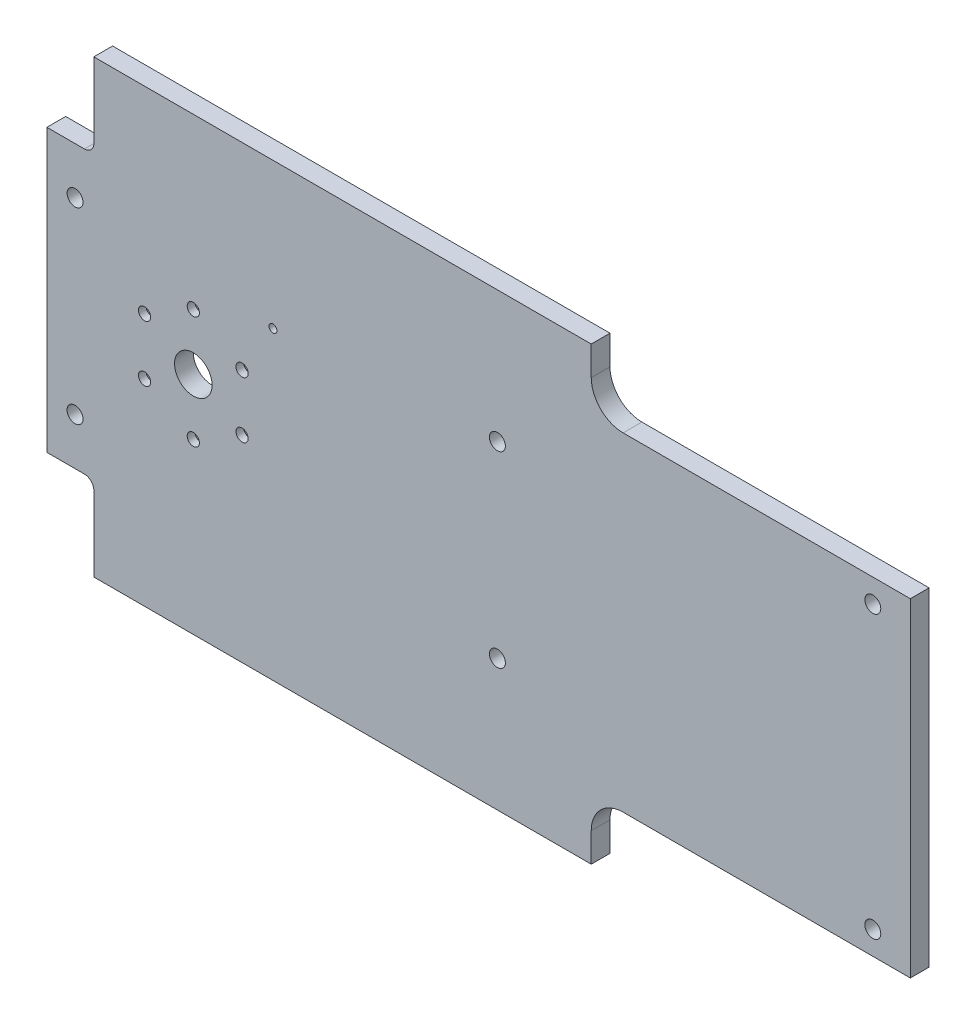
ISO-10303-21;
HEADER;
FILE_DESCRIPTION(('STEP AP214'),'2;1');
FILE_NAME('part.step','',(''),(''),'','','');
FILE_SCHEMA(('AUTOMOTIVE_DESIGN { 1 0 10303 214 1 1 1 1 }'));
ENDSEC;
DATA;
#1=APPLICATION_CONTEXT('core data for automotive mechanical design processes');
#2=APPLICATION_PROTOCOL_DEFINITION('international standard','automotive_design',2000,#1);
#3=PRODUCT_CONTEXT('',#1,'mechanical');
#4=PRODUCT('Part','Part','',(#3));
#5=PRODUCT_RELATED_PRODUCT_CATEGORY('part','',(#4));
#6=PRODUCT_DEFINITION_FORMATION('','',#4);
#7=PRODUCT_DEFINITION_CONTEXT('part definition',#1,'design');
#8=PRODUCT_DEFINITION('design','',#6,#7);
#9=PRODUCT_DEFINITION_SHAPE('','',#8);
#10=(LENGTH_UNIT() NAMED_UNIT(*) SI_UNIT(.MILLI.,.METRE.));
#11=(NAMED_UNIT(*) PLANE_ANGLE_UNIT() SI_UNIT($,.RADIAN.));
#12=(NAMED_UNIT(*) SI_UNIT($,.STERADIAN.) SOLID_ANGLE_UNIT());
#13=UNCERTAINTY_MEASURE_WITH_UNIT(LENGTH_MEASURE(1.E-05),#10,'distance_accuracy_value','');
#14=(GEOMETRIC_REPRESENTATION_CONTEXT(3) GLOBAL_UNCERTAINTY_ASSIGNED_CONTEXT((#13)) GLOBAL_UNIT_ASSIGNED_CONTEXT((#10,
#11,#12)) REPRESENTATION_CONTEXT('',''));
#15=CARTESIAN_POINT('',(0.,0.,0.));
#16=DIRECTION('',(0.,0.,1.));
#17=DIRECTION('',(1.,0.,0.));
#18=AXIS2_PLACEMENT_3D('',#15,#16,#17);
#19=CARTESIAN_POINT('',(-25.9807621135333,-14.9999999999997,0.));
#20=DIRECTION('',(0.,0.,1.));
#21=DIRECTION('',(1.,0.,0.));
#22=AXIS2_PLACEMENT_3D('',#19,#20,#21);
#23=CYLINDRICAL_SURFACE('',#22,3.25);
#24=CARTESIAN_POINT('',(-25.9807621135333,-14.9999999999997,10.));
#25=DIRECTION('',(0.,0.,1.));
#26=DIRECTION('',(0.50000000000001,0.866025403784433,0.));
#27=AXIS2_PLACEMENT_3D('',#24,#25,#26);
#28=CIRCLE('',#27,3.25);
#29=CARTESIAN_POINT('',(-24.3557621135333,-12.1854174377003,10.));
#30=VERTEX_POINT('',#29);
#31=EDGE_CURVE('E271',#30,#30,#28,.T.);
#32=ORIENTED_EDGE('',*,*,#31,.T.);
#33=EDGE_LOOP('',(#32));
#34=FACE_BOUND('',#33,.T.);
#35=CARTESIAN_POINT('',(-25.9807621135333,-14.9999999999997,6.));
#36=DIRECTION('',(0.,0.,-1.));
#37=DIRECTION('',(-1.,0.,0.));
#38=AXIS2_PLACEMENT_3D('',#35,#36,#37);
#39=CIRCLE('',#38,3.25);
#40=CARTESIAN_POINT('',(-29.2307621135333,-14.9999999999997,6.));
#41=VERTEX_POINT('',#40);
#42=EDGE_CURVE('E32',#41,#41,#39,.F.);
#43=ORIENTED_EDGE('',*,*,#42,.F.);
#44=EDGE_LOOP('',(#43));
#45=FACE_BOUND('',#44,.T.);
#46=ADVANCED_FACE('F28',(#34,#45),#23,.F.);
#47=CARTESIAN_POINT('',(-3.07046055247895E-13,-30.,0.));
#48=DIRECTION('',(0.,0.,1.));
#49=DIRECTION('',(1.,0.,0.));
#50=AXIS2_PLACEMENT_3D('',#47,#48,#49);
#51=CYLINDRICAL_SURFACE('',#50,3.25);
#52=CARTESIAN_POINT('',(-3.07046055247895E-13,-30.,10.));
#53=DIRECTION('',(0.,0.,1.));
#54=DIRECTION('',(-0.499999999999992,0.866025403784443,0.));
#55=AXIS2_PLACEMENT_3D('',#52,#53,#54);
#56=CIRCLE('',#55,3.25);
#57=CARTESIAN_POINT('',(-1.62500000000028,-27.1854174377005,10.));
#58=VERTEX_POINT('',#57);
#59=EDGE_CURVE('E311',#58,#58,#56,.T.);
#60=ORIENTED_EDGE('',*,*,#59,.T.);
#61=EDGE_LOOP('',(#60));
#62=FACE_BOUND('',#61,.T.);
#63=CARTESIAN_POINT('',(-3.07046055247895E-13,-30.,6.));
#64=DIRECTION('',(0.,0.,-1.));
#65=DIRECTION('',(-1.,0.,0.));
#66=AXIS2_PLACEMENT_3D('',#63,#64,#65);
#67=CIRCLE('',#66,3.25);
#68=CARTESIAN_POINT('',(-3.25000000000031,-30.,6.));
#69=VERTEX_POINT('',#68);
#70=EDGE_CURVE('E282',#69,#69,#67,.F.);
#71=ORIENTED_EDGE('',*,*,#70,.F.);
#72=EDGE_LOOP('',(#71));
#73=FACE_BOUND('',#72,.T.);
#74=ADVANCED_FACE('F353',(#62,#73),#51,.F.);
#75=CARTESIAN_POINT('',(25.980762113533,-15.0000000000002,0.));
#76=DIRECTION('',(0.,0.,1.));
#77=DIRECTION('',(1.,0.,0.));
#78=AXIS2_PLACEMENT_3D('',#75,#76,#77);
#79=CYLINDRICAL_SURFACE('',#78,3.25);
#80=CARTESIAN_POINT('',(25.980762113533,-15.0000000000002,10.));
#81=DIRECTION('',(0.,0.,1.));
#82=DIRECTION('',(-1.,0.,0.));
#83=AXIS2_PLACEMENT_3D('',#80,#81,#82);
#84=CIRCLE('',#83,3.25);
#85=CARTESIAN_POINT('',(22.730762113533,-15.0000000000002,10.));
#86=VERTEX_POINT('',#85);
#87=EDGE_CURVE('E314',#86,#86,#84,.T.);
#88=ORIENTED_EDGE('',*,*,#87,.T.);
#89=EDGE_LOOP('',(#88));
#90=FACE_BOUND('',#89,.T.);
#91=CARTESIAN_POINT('',(25.980762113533,-15.0000000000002,6.));
#92=DIRECTION('',(0.,0.,-1.));
#93=DIRECTION('',(-1.,0.,0.));
#94=AXIS2_PLACEMENT_3D('',#91,#92,#93);
#95=CIRCLE('',#94,3.25);
#96=CARTESIAN_POINT('',(22.730762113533,-15.0000000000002,6.));
#97=VERTEX_POINT('',#96);
#98=EDGE_CURVE('E278',#97,#97,#95,.F.);
#99=ORIENTED_EDGE('',*,*,#98,.F.);
#100=EDGE_LOOP('',(#99));
#101=FACE_BOUND('',#100,.T.);
#102=ADVANCED_FACE('F359',(#90,#101),#79,.F.);
#103=CARTESIAN_POINT('',(25.9807621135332,14.9999999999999,0.));
#104=DIRECTION('',(0.,0.,1.));
#105=DIRECTION('',(1.,0.,0.));
#106=AXIS2_PLACEMENT_3D('',#103,#104,#105);
#107=CYLINDRICAL_SURFACE('',#106,3.25);
#108=CARTESIAN_POINT('',(25.9807621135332,14.9999999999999,10.));
#109=DIRECTION('',(0.,0.,1.));
#110=DIRECTION('',(-0.500000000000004,-0.866025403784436,0.));
#111=AXIS2_PLACEMENT_3D('',#108,#109,#110);
#112=CIRCLE('',#111,3.25);
#113=CARTESIAN_POINT('',(24.3557621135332,12.1854174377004,10.));
#114=VERTEX_POINT('',#113);
#115=EDGE_CURVE('E317',#114,#114,#112,.T.);
#116=ORIENTED_EDGE('',*,*,#115,.T.);
#117=EDGE_LOOP('',(#116));
#118=FACE_BOUND('',#117,.T.);
#119=CARTESIAN_POINT('',(25.9807621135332,14.9999999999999,6.));
#120=DIRECTION('',(0.,0.,-1.));
#121=DIRECTION('',(-1.,0.,0.));
#122=AXIS2_PLACEMENT_3D('',#119,#120,#121);
#123=CIRCLE('',#122,3.25);
#124=CARTESIAN_POINT('',(22.7307621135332,14.9999999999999,6.));
#125=VERTEX_POINT('',#124);
#126=EDGE_CURVE('E273',#125,#125,#123,.F.);
#127=ORIENTED_EDGE('',*,*,#126,.F.);
#128=EDGE_LOOP('',(#127));
#129=FACE_BOUND('',#128,.T.);
#130=ADVANCED_FACE('F369',(#118,#129),#107,.F.);
#131=CARTESIAN_POINT('',(0.,30.,0.));
#132=DIRECTION('',(0.,0.,1.));
#133=DIRECTION('',(1.,0.,0.));
#134=AXIS2_PLACEMENT_3D('',#131,#132,#133);
#135=CYLINDRICAL_SURFACE('',#134,3.25);
#136=CARTESIAN_POINT('',(0.,30.,10.));
#137=DIRECTION('',(0.,0.,1.));
#138=DIRECTION('',(0.499999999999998,-0.86602540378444,0.));
#139=AXIS2_PLACEMENT_3D('',#136,#137,#138);
#140=CIRCLE('',#139,3.25);
#141=CARTESIAN_POINT('',(1.62500000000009,27.1854174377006,10.));
#142=VERTEX_POINT('',#141);
#143=EDGE_CURVE('E320',#142,#142,#140,.T.);
#144=ORIENTED_EDGE('',*,*,#143,.T.);
#145=EDGE_LOOP('',(#144));
#146=FACE_BOUND('',#145,.T.);
#147=CARTESIAN_POINT('',(0.,30.,6.));
#148=DIRECTION('',(0.,0.,-1.));
#149=DIRECTION('',(-1.,0.,0.));
#150=AXIS2_PLACEMENT_3D('',#147,#148,#149);
#151=CIRCLE('',#150,3.25);
#152=CARTESIAN_POINT('',(-3.24999999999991,30.,6.));
#153=VERTEX_POINT('',#152);
#154=EDGE_CURVE('E268',#153,#153,#151,.F.);
#155=ORIENTED_EDGE('',*,*,#154,.F.);
#156=EDGE_LOOP('',(#155));
#157=FACE_BOUND('',#156,.T.);
#158=ADVANCED_FACE('F373',(#146,#157),#135,.F.);
#159=CARTESIAN_POINT('',(-25.9807621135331,15.,0.));
#160=DIRECTION('',(0.,0.,1.));
#161=DIRECTION('',(1.,0.,0.));
#162=AXIS2_PLACEMENT_3D('',#159,#160,#161);
#163=CYLINDRICAL_SURFACE('',#162,3.25);
#164=CARTESIAN_POINT('',(-25.9807621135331,15.,10.));
#165=DIRECTION('',(0.,0.,1.));
#166=DIRECTION('',(1.,0.,0.));
#167=AXIS2_PLACEMENT_3D('',#164,#165,#166);
#168=CIRCLE('',#167,3.25);
#169=CARTESIAN_POINT('',(-22.7307621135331,15.,10.));
#170=VERTEX_POINT('',#169);
#171=EDGE_CURVE('E161',#170,#170,#168,.T.);
#172=ORIENTED_EDGE('',*,*,#171,.T.);
#173=EDGE_LOOP('',(#172));
#174=FACE_BOUND('',#173,.T.);
#175=CARTESIAN_POINT('',(-25.9807621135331,15.,6.));
#176=DIRECTION('',(0.,0.,-1.));
#177=DIRECTION('',(-1.,0.,0.));
#178=AXIS2_PLACEMENT_3D('',#175,#176,#177);
#179=CIRCLE('',#178,3.25);
#180=CARTESIAN_POINT('',(-29.2307621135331,15.,6.));
#181=VERTEX_POINT('',#180);
#182=EDGE_CURVE('E164',#181,#181,#179,.F.);
#183=ORIENTED_EDGE('',*,*,#182,.F.);
#184=EDGE_LOOP('',(#183));
#185=FACE_BOUND('',#184,.T.);
#186=ADVANCED_FACE('F346',(#174,#185),#163,.F.);
#187=CARTESIAN_POINT('',(-58.,-80.,10.));
#188=DIRECTION('',(0.,0.,1.));
#189=DIRECTION('',(1.,0.,0.));
#190=AXIS2_PLACEMENT_3D('',#187,#188,#189);
#191=PLANE('',#190);
#192=CARTESIAN_POINT('',(0.,0.,10.));
#193=DIRECTION('',(0.,0.,1.));
#194=DIRECTION('',(1.,0.,0.));
#195=AXIS2_PLACEMENT_3D('',#192,#193,#194);
#196=CIRCLE('',#195,10.);
#197=CARTESIAN_POINT('',(10.,0.,10.));
#198=VERTEX_POINT('',#197);
#199=EDGE_CURVE('E721',#198,#198,#196,.T.);
#200=ORIENTED_EDGE('',*,*,#199,.F.);
#201=EDGE_LOOP('',(#200));
#202=FACE_BOUND('',#201,.T.);
#203=CARTESIAN_POINT('',(42.43,42.43,10.));
#204=DIRECTION('',(0.,0.,1.));
#205=DIRECTION('',(1.,0.,0.));
#206=AXIS2_PLACEMENT_3D('',#203,#204,#205);
#207=CIRCLE('',#206,2.1);
#208=CARTESIAN_POINT('',(44.53,42.43,10.));
#209=VERTEX_POINT('',#208);
#210=EDGE_CURVE('E723',#209,#209,#207,.T.);
#211=ORIENTED_EDGE('',*,*,#210,.F.);
#212=EDGE_LOOP('',(#211));
#213=FACE_BOUND('',#212,.T.);
#214=CARTESIAN_POINT('',(-63.,-50.,10.));
#215=DIRECTION('',(0.,0.,1.));
#216=DIRECTION('',(1.,0.,0.));
#217=AXIS2_PLACEMENT_3D('',#214,#215,#216);
#218=CIRCLE('',#217,4.25000000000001);
#219=CARTESIAN_POINT('',(-58.75,-50.,10.));
#220=VERTEX_POINT('',#219);
#221=EDGE_CURVE('E731',#220,#220,#218,.T.);
#222=ORIENTED_EDGE('',*,*,#221,.F.);
#223=EDGE_LOOP('',(#222));
#224=FACE_BOUND('',#223,.T.);
#225=CARTESIAN_POINT('',(-63.,50.,10.));
#226=DIRECTION('',(0.,0.,1.));
#227=DIRECTION('',(1.,0.,0.));
#228=AXIS2_PLACEMENT_3D('',#225,#226,#227);
#229=CIRCLE('',#228,4.25000000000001);
#230=CARTESIAN_POINT('',(-58.75,50.,10.));
#231=VERTEX_POINT('',#230);
#232=EDGE_CURVE('E737',#231,#231,#229,.T.);
#233=ORIENTED_EDGE('',*,*,#232,.F.);
#234=EDGE_LOOP('',(#233));
#235=FACE_BOUND('',#234,.T.);
#236=CARTESIAN_POINT('',(162.,50.,10.));
#237=DIRECTION('',(0.,0.,1.));
#238=DIRECTION('',(1.,0.,0.));
#239=AXIS2_PLACEMENT_3D('',#236,#237,#238);
#240=CIRCLE('',#239,4.25000000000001);
#241=CARTESIAN_POINT('',(166.25,50.,10.));
#242=VERTEX_POINT('',#241);
#243=EDGE_CURVE('E743',#242,#242,#240,.T.);
#244=ORIENTED_EDGE('',*,*,#243,.F.);
#245=EDGE_LOOP('',(#244));
#246=FACE_BOUND('',#245,.T.);
#247=CARTESIAN_POINT('',(162.,-50.,10.));
#248=DIRECTION('',(0.,0.,1.));
#249=DIRECTION('',(1.,0.,0.));
#250=AXIS2_PLACEMENT_3D('',#247,#248,#249);
#251=CIRCLE('',#250,4.25000000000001);
#252=CARTESIAN_POINT('',(166.25,-50.,10.));
#253=VERTEX_POINT('',#252);
#254=EDGE_CURVE('E749',#253,#253,#251,.T.);
#255=ORIENTED_EDGE('',*,*,#254,.F.);
#256=EDGE_LOOP('',(#255));
#257=FACE_BOUND('',#256,.T.);
#258=CARTESIAN_POINT('',(362.,-75.,10.));
#259=DIRECTION('',(0.,0.,1.));
#260=DIRECTION('',(1.,0.,0.));
#261=AXIS2_PLACEMENT_3D('',#258,#259,#260);
#262=CIRCLE('',#261,4.24999999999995);
#263=CARTESIAN_POINT('',(366.25,-75.,10.));
#264=VERTEX_POINT('',#263);
#265=EDGE_CURVE('E755',#264,#264,#262,.T.);
#266=ORIENTED_EDGE('',*,*,#265,.F.);
#267=EDGE_LOOP('',(#266));
#268=FACE_BOUND('',#267,.T.);
#269=CARTESIAN_POINT('',(362.,75.,10.));
#270=DIRECTION('',(0.,0.,1.));
#271=DIRECTION('',(1.,0.,0.));
#272=AXIS2_PLACEMENT_3D('',#269,#270,#271);
#273=CIRCLE('',#272,4.24999999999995);
#274=CARTESIAN_POINT('',(366.25,75.,10.));
#275=VERTEX_POINT('',#274);
#276=EDGE_CURVE('E761',#275,#275,#273,.T.);
#277=ORIENTED_EDGE('',*,*,#276,.F.);
#278=EDGE_LOOP('',(#277));
#279=FACE_BOUND('',#278,.T.);
#280=ORIENTED_EDGE('',*,*,#31,.F.);
#281=EDGE_LOOP('',(#280));
#282=FACE_BOUND('',#281,.T.);
#283=ORIENTED_EDGE('',*,*,#59,.F.);
#284=EDGE_LOOP('',(#283));
#285=FACE_BOUND('',#284,.T.);
#286=ORIENTED_EDGE('',*,*,#87,.F.);
#287=EDGE_LOOP('',(#286));
#288=FACE_BOUND('',#287,.T.);
#289=ORIENTED_EDGE('',*,*,#115,.F.);
#290=EDGE_LOOP('',(#289));
#291=FACE_BOUND('',#290,.T.);
#292=ORIENTED_EDGE('',*,*,#143,.F.);
#293=EDGE_LOOP('',(#292));
#294=FACE_BOUND('',#293,.T.);
#295=ORIENTED_EDGE('',*,*,#171,.F.);
#296=EDGE_LOOP('',(#295));
#297=FACE_BOUND('',#296,.T.);
#298=DIRECTION('',(0.,-1.,0.));
#299=VECTOR('',#298,1.);
#300=CARTESIAN_POINT('',(-53.,-120.,10.));
#301=LINE('',#300,#299);
#302=CARTESIAN_POINT('',(-53.,-80.,10.));
#303=VERTEX_POINT('',#302);
#304=CARTESIAN_POINT('',(-53.,-120.,10.));
#305=VERTEX_POINT('',#304);
#306=EDGE_CURVE('E195',#303,#305,#301,.T.);
#307=ORIENTED_EDGE('',*,*,#306,.T.);
#308=DIRECTION('',(1.,0.,0.));
#309=VECTOR('',#308,1.);
#310=CARTESIAN_POINT('',(-53.,-120.,10.));
#311=LINE('',#310,#309);
#312=CARTESIAN_POINT('',(212.,-120.,10.));
#313=VERTEX_POINT('',#312);
#314=EDGE_CURVE('E156',#305,#313,#311,.T.);
#315=ORIENTED_EDGE('',*,*,#314,.T.);
#316=DIRECTION('',(0.,1.,0.));
#317=VECTOR('',#316,1.);
#318=CARTESIAN_POINT('',(212.,-104.5,10.));
#319=LINE('',#318,#317);
#320=CARTESIAN_POINT('',(212.,-104.5,10.));
#321=VERTEX_POINT('',#320);
#322=EDGE_CURVE('E198',#313,#321,#319,.T.);
#323=ORIENTED_EDGE('',*,*,#322,.T.);
#324=CARTESIAN_POINT('',(229.,-104.5,10.));
#325=DIRECTION('',(0.,0.,-1.));
#326=DIRECTION('',(-1.,0.,0.));
#327=AXIS2_PLACEMENT_3D('',#324,#325,#326);
#328=CIRCLE('',#327,17.);
#329=CARTESIAN_POINT('',(229.,-87.5,10.));
#330=VERTEX_POINT('',#329);
#331=EDGE_CURVE('E200',#321,#330,#328,.T.);
#332=ORIENTED_EDGE('',*,*,#331,.T.);
#333=DIRECTION('',(1.,0.,0.));
#334=VECTOR('',#333,1.);
#335=CARTESIAN_POINT('',(382.,-87.5,10.));
#336=LINE('',#335,#334);
#337=CARTESIAN_POINT('',(382.,-87.5,10.));
#338=VERTEX_POINT('',#337);
#339=EDGE_CURVE('E202',#330,#338,#336,.T.);
#340=ORIENTED_EDGE('',*,*,#339,.T.);
#341=DIRECTION('',(0.,1.,0.));
#342=VECTOR('',#341,1.);
#343=CARTESIAN_POINT('',(382.,87.5,10.));
#344=LINE('',#343,#342);
#345=CARTESIAN_POINT('',(382.,87.5,10.));
#346=VERTEX_POINT('',#345);
#347=EDGE_CURVE('E204',#338,#346,#344,.T.);
#348=ORIENTED_EDGE('',*,*,#347,.T.);
#349=DIRECTION('',(-1.,0.,0.));
#350=VECTOR('',#349,1.);
#351=CARTESIAN_POINT('',(382.,87.5,10.));
#352=LINE('',#351,#350);
#353=CARTESIAN_POINT('',(229.,87.5,10.));
#354=VERTEX_POINT('',#353);
#355=EDGE_CURVE('E206',#346,#354,#352,.T.);
#356=ORIENTED_EDGE('',*,*,#355,.T.);
#357=CARTESIAN_POINT('',(229.,104.5,10.));
#358=DIRECTION('',(0.,0.,-1.));
#359=DIRECTION('',(1.,0.,0.));
#360=AXIS2_PLACEMENT_3D('',#357,#358,#359);
#361=CIRCLE('',#360,17.);
#362=CARTESIAN_POINT('',(212.,104.5,10.));
#363=VERTEX_POINT('',#362);
#364=EDGE_CURVE('E208',#354,#363,#361,.T.);
#365=ORIENTED_EDGE('',*,*,#364,.T.);
#366=DIRECTION('',(0.,1.,0.));
#367=VECTOR('',#366,1.);
#368=CARTESIAN_POINT('',(212.,104.5,10.));
#369=LINE('',#368,#367);
#370=CARTESIAN_POINT('',(212.,120.,10.));
#371=VERTEX_POINT('',#370);
#372=EDGE_CURVE('E210',#363,#371,#369,.T.);
#373=ORIENTED_EDGE('',*,*,#372,.T.);
#374=DIRECTION('',(-1.,0.,0.));
#375=VECTOR('',#374,1.);
#376=CARTESIAN_POINT('',(-53.,120.,10.));
#377=LINE('',#376,#375);
#378=CARTESIAN_POINT('',(-53.,120.,10.));
#379=VERTEX_POINT('',#378);
#380=EDGE_CURVE('E212',#371,#379,#377,.T.);
#381=ORIENTED_EDGE('',*,*,#380,.T.);
#382=DIRECTION('',(0.,-1.,0.));
#383=VECTOR('',#382,1.);
#384=CARTESIAN_POINT('',(-53.,120.,10.));
#385=LINE('',#384,#383);
#386=CARTESIAN_POINT('',(-53.,80.,10.));
#387=VERTEX_POINT('',#386);
#388=EDGE_CURVE('E214',#379,#387,#385,.T.);
#389=ORIENTED_EDGE('',*,*,#388,.T.);
#390=CARTESIAN_POINT('',(-58.,80.,10.));
#391=DIRECTION('',(0.,0.,-1.));
#392=DIRECTION('',(-1.,0.,0.));
#393=AXIS2_PLACEMENT_3D('',#390,#391,#392);
#394=CIRCLE('',#393,5.);
#395=CARTESIAN_POINT('',(-58.,75.,10.));
#396=VERTEX_POINT('',#395);
#397=EDGE_CURVE('E216',#387,#396,#394,.T.);
#398=ORIENTED_EDGE('',*,*,#397,.T.);
#399=DIRECTION('',(-1.,0.,0.));
#400=VECTOR('',#399,1.);
#401=CARTESIAN_POINT('',(-78.,75.,10.));
#402=LINE('',#401,#400);
#403=CARTESIAN_POINT('',(-78.,75.,10.));
#404=VERTEX_POINT('',#403);
#405=EDGE_CURVE('E218',#396,#404,#402,.T.);
#406=ORIENTED_EDGE('',*,*,#405,.T.);
#407=DIRECTION('',(0.,-1.,0.));
#408=VECTOR('',#407,1.);
#409=CARTESIAN_POINT('',(-78.,75.,10.));
#410=LINE('',#409,#408);
#411=CARTESIAN_POINT('',(-78.,-75.,10.));
#412=VERTEX_POINT('',#411);
#413=EDGE_CURVE('E220',#404,#412,#410,.T.);
#414=ORIENTED_EDGE('',*,*,#413,.T.);
#415=DIRECTION('',(1.,0.,0.));
#416=VECTOR('',#415,1.);
#417=CARTESIAN_POINT('',(-78.,-75.,10.));
#418=LINE('',#417,#416);
#419=CARTESIAN_POINT('',(-58.,-75.,10.));
#420=VERTEX_POINT('',#419);
#421=EDGE_CURVE('E50',#412,#420,#418,.T.);
#422=ORIENTED_EDGE('',*,*,#421,.T.);
#423=CARTESIAN_POINT('',(-58.,-80.,10.));
#424=DIRECTION('',(0.,0.,-1.));
#425=DIRECTION('',(1.,0.,0.));
#426=AXIS2_PLACEMENT_3D('',#423,#424,#425);
#427=CIRCLE('',#426,5.);
#428=EDGE_CURVE('E45',#420,#303,#427,.T.);
#429=ORIENTED_EDGE('',*,*,#428,.T.);
#430=EDGE_LOOP('',(#307,#315,#323,#332,#340,#348,#356,#365,#373,#381,#389,#398,#406,#414,#422,#429));
#431=FACE_BOUND('',#430,.T.);
#432=ADVANCED_FACE('F339',(#202,#213,#224,#235,#246,#257,#268,#279,#282,#285,#288,#291,#294,
#297,#431),#191,.T.);
#433=CARTESIAN_POINT('',(-58.,-80.,0.));
#434=DIRECTION('',(0.,0.,1.));
#435=DIRECTION('',(1.,0.,0.));
#436=AXIS2_PLACEMENT_3D('',#433,#434,#435);
#437=PLANE('',#436);
#438=CARTESIAN_POINT('',(0.,0.,0.));
#439=DIRECTION('',(0.,0.,1.));
#440=DIRECTION('',(1.,0.,0.));
#441=AXIS2_PLACEMENT_3D('',#438,#439,#440);
#442=CIRCLE('',#441,10.);
#443=CARTESIAN_POINT('',(10.,0.,0.));
#444=VERTEX_POINT('',#443);
#445=EDGE_CURVE('E718',#444,#444,#442,.T.);
#446=ORIENTED_EDGE('',*,*,#445,.T.);
#447=EDGE_LOOP('',(#446));
#448=FACE_BOUND('',#447,.T.);
#449=CARTESIAN_POINT('',(42.43,42.43,0.));
#450=DIRECTION('',(0.,0.,1.));
#451=DIRECTION('',(1.,0.,0.));
#452=AXIS2_PLACEMENT_3D('',#449,#450,#451);
#453=CIRCLE('',#452,2.1);
#454=CARTESIAN_POINT('',(44.53,42.43,0.));
#455=VERTEX_POINT('',#454);
#456=EDGE_CURVE('E728',#455,#455,#453,.T.);
#457=ORIENTED_EDGE('',*,*,#456,.T.);
#458=EDGE_LOOP('',(#457));
#459=FACE_BOUND('',#458,.T.);
#460=CARTESIAN_POINT('',(-63.,-50.,0.));
#461=DIRECTION('',(0.,0.,1.));
#462=DIRECTION('',(1.,0.,0.));
#463=AXIS2_PLACEMENT_3D('',#460,#461,#462);
#464=CIRCLE('',#463,4.25000000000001);
#465=CARTESIAN_POINT('',(-58.75,-50.,0.));
#466=VERTEX_POINT('',#465);
#467=EDGE_CURVE('E734',#466,#466,#464,.T.);
#468=ORIENTED_EDGE('',*,*,#467,.T.);
#469=EDGE_LOOP('',(#468));
#470=FACE_BOUND('',#469,.T.);
#471=CARTESIAN_POINT('',(-63.,50.,0.));
#472=DIRECTION('',(0.,0.,1.));
#473=DIRECTION('',(1.,0.,0.));
#474=AXIS2_PLACEMENT_3D('',#471,#472,#473);
#475=CIRCLE('',#474,4.25000000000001);
#476=CARTESIAN_POINT('',(-58.75,50.,0.));
#477=VERTEX_POINT('',#476);
#478=EDGE_CURVE('E740',#477,#477,#475,.T.);
#479=ORIENTED_EDGE('',*,*,#478,.T.);
#480=EDGE_LOOP('',(#479));
#481=FACE_BOUND('',#480,.T.);
#482=CARTESIAN_POINT('',(162.,50.,0.));
#483=DIRECTION('',(0.,0.,1.));
#484=DIRECTION('',(1.,0.,0.));
#485=AXIS2_PLACEMENT_3D('',#482,#483,#484);
#486=CIRCLE('',#485,4.25000000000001);
#487=CARTESIAN_POINT('',(166.25,50.,0.));
#488=VERTEX_POINT('',#487);
#489=EDGE_CURVE('E746',#488,#488,#486,.T.);
#490=ORIENTED_EDGE('',*,*,#489,.T.);
#491=EDGE_LOOP('',(#490));
#492=FACE_BOUND('',#491,.T.);
#493=CARTESIAN_POINT('',(162.,-50.,0.));
#494=DIRECTION('',(0.,0.,1.));
#495=DIRECTION('',(1.,0.,0.));
#496=AXIS2_PLACEMENT_3D('',#493,#494,#495);
#497=CIRCLE('',#496,4.25000000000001);
#498=CARTESIAN_POINT('',(166.25,-50.,0.));
#499=VERTEX_POINT('',#498);
#500=EDGE_CURVE('E752',#499,#499,#497,.T.);
#501=ORIENTED_EDGE('',*,*,#500,.T.);
#502=EDGE_LOOP('',(#501));
#503=FACE_BOUND('',#502,.T.);
#504=CARTESIAN_POINT('',(362.,-75.,0.));
#505=DIRECTION('',(0.,0.,1.));
#506=DIRECTION('',(1.,0.,0.));
#507=AXIS2_PLACEMENT_3D('',#504,#505,#506);
#508=CIRCLE('',#507,4.24999999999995);
#509=CARTESIAN_POINT('',(366.25,-75.,0.));
#510=VERTEX_POINT('',#509);
#511=EDGE_CURVE('E758',#510,#510,#508,.T.);
#512=ORIENTED_EDGE('',*,*,#511,.T.);
#513=EDGE_LOOP('',(#512));
#514=FACE_BOUND('',#513,.T.);
#515=CARTESIAN_POINT('',(362.,75.,0.));
#516=DIRECTION('',(0.,0.,1.));
#517=DIRECTION('',(1.,0.,0.));
#518=AXIS2_PLACEMENT_3D('',#515,#516,#517);
#519=CIRCLE('',#518,4.24999999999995);
#520=CARTESIAN_POINT('',(366.25,75.,0.));
#521=VERTEX_POINT('',#520);
#522=EDGE_CURVE('E764',#521,#521,#519,.T.);
#523=ORIENTED_EDGE('',*,*,#522,.T.);
#524=EDGE_LOOP('',(#523));
#525=FACE_BOUND('',#524,.T.);
#526=CARTESIAN_POINT('',(-25.9807621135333,-14.9999999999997,0.));
#527=DIRECTION('',(0.,0.,-1.));
#528=DIRECTION('',(-0.50000000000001,-0.866025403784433,0.));
#529=AXIS2_PLACEMENT_3D('',#526,#527,#528);
#530=CIRCLE('',#529,6.5);
#531=CARTESIAN_POINT('',(-29.2307621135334,-20.6291651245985,0.));
#532=VERTEX_POINT('',#531);
#533=EDGE_CURVE('E767',#532,#532,#530,.T.);
#534=ORIENTED_EDGE('',*,*,#533,.F.);
#535=EDGE_LOOP('',(#534));
#536=FACE_BOUND('',#535,.T.);
#537=CARTESIAN_POINT('',(-3.07046055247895E-13,-30.,0.));
#538=DIRECTION('',(0.,0.,-1.));
#539=DIRECTION('',(0.499999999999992,-0.866025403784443,0.));
#540=AXIS2_PLACEMENT_3D('',#537,#538,#539);
#541=CIRCLE('',#540,6.5);
#542=CARTESIAN_POINT('',(3.24999999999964,-35.6291651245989,0.));
#543=VERTEX_POINT('',#542);
#544=EDGE_CURVE('E291',#543,#543,#541,.T.);
#545=ORIENTED_EDGE('',*,*,#544,.F.);
#546=EDGE_LOOP('',(#545));
#547=FACE_BOUND('',#546,.T.);
#548=CARTESIAN_POINT('',(25.980762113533,-15.0000000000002,0.));
#549=DIRECTION('',(0.,0.,-1.));
#550=DIRECTION('',(1.,0.,0.));
#551=AXIS2_PLACEMENT_3D('',#548,#549,#550);
#552=CIRCLE('',#551,6.5);
#553=CARTESIAN_POINT('',(32.480762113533,-15.0000000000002,0.));
#554=VERTEX_POINT('',#553);
#555=EDGE_CURVE('E284',#554,#554,#552,.T.);
#556=ORIENTED_EDGE('',*,*,#555,.F.);
#557=EDGE_LOOP('',(#556));
#558=FACE_BOUND('',#557,.T.);
#559=CARTESIAN_POINT('',(25.9807621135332,14.9999999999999,0.));
#560=DIRECTION('',(0.,0.,-1.));
#561=DIRECTION('',(0.500000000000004,0.866025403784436,0.));
#562=AXIS2_PLACEMENT_3D('',#559,#560,#561);
#563=CIRCLE('',#562,6.5);
#564=CARTESIAN_POINT('',(29.2307621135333,20.6291651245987,0.));
#565=VERTEX_POINT('',#564);
#566=EDGE_CURVE('E280',#565,#565,#563,.T.);
#567=ORIENTED_EDGE('',*,*,#566,.F.);
#568=EDGE_LOOP('',(#567));
#569=FACE_BOUND('',#568,.T.);
#570=CARTESIAN_POINT('',(0.,30.,0.));
#571=DIRECTION('',(0.,0.,-1.));
#572=DIRECTION('',(-0.499999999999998,0.86602540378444,0.));
#573=AXIS2_PLACEMENT_3D('',#570,#571,#572);
#574=CIRCLE('',#573,6.5);
#575=CARTESIAN_POINT('',(-3.24999999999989,35.6291651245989,0.));
#576=VERTEX_POINT('',#575);
#577=EDGE_CURVE('E276',#576,#576,#574,.T.);
#578=ORIENTED_EDGE('',*,*,#577,.F.);
#579=EDGE_LOOP('',(#578));
#580=FACE_BOUND('',#579,.T.);
#581=CARTESIAN_POINT('',(-25.9807621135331,15.,0.));
#582=DIRECTION('',(0.,0.,-1.));
#583=DIRECTION('',(-1.,0.,0.));
#584=AXIS2_PLACEMENT_3D('',#581,#582,#583);
#585=CIRCLE('',#584,6.5);
#586=CARTESIAN_POINT('',(-32.4807621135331,15.,0.));
#587=VERTEX_POINT('',#586);
#588=EDGE_CURVE('E323',#587,#587,#585,.T.);
#589=ORIENTED_EDGE('',*,*,#588,.F.);
#590=EDGE_LOOP('',(#589));
#591=FACE_BOUND('',#590,.T.);
#592=DIRECTION('',(0.,-1.,0.));
#593=VECTOR('',#592,1.);
#594=CARTESIAN_POINT('',(-53.,-120.,0.));
#595=LINE('',#594,#593);
#596=CARTESIAN_POINT('',(-53.,-80.,0.));
#597=VERTEX_POINT('',#596);
#598=CARTESIAN_POINT('',(-53.,-120.,0.));
#599=VERTEX_POINT('',#598);
#600=EDGE_CURVE('E147',#597,#599,#595,.T.);
#601=ORIENTED_EDGE('',*,*,#600,.F.);
#602=CARTESIAN_POINT('',(-58.,-80.,0.));
#603=DIRECTION('',(0.,0.,-1.));
#604=DIRECTION('',(1.,0.,0.));
#605=AXIS2_PLACEMENT_3D('',#602,#603,#604);
#606=CIRCLE('',#605,5.);
#607=CARTESIAN_POINT('',(-58.,-75.,0.));
#608=VERTEX_POINT('',#607);
#609=EDGE_CURVE('E193',#608,#597,#606,.T.);
#610=ORIENTED_EDGE('',*,*,#609,.F.);
#611=DIRECTION('',(1.,0.,0.));
#612=VECTOR('',#611,1.);
#613=CARTESIAN_POINT('',(-78.,-75.,0.));
#614=LINE('',#613,#612);
#615=CARTESIAN_POINT('',(-78.,-75.,0.));
#616=VERTEX_POINT('',#615);
#617=EDGE_CURVE('E191',#616,#608,#614,.T.);
#618=ORIENTED_EDGE('',*,*,#617,.F.);
#619=DIRECTION('',(0.,-1.,0.));
#620=VECTOR('',#619,1.);
#621=CARTESIAN_POINT('',(-78.,75.,0.));
#622=LINE('',#621,#620);
#623=CARTESIAN_POINT('',(-78.,75.,0.));
#624=VERTEX_POINT('',#623);
#625=EDGE_CURVE('E189',#624,#616,#622,.T.);
#626=ORIENTED_EDGE('',*,*,#625,.F.);
#627=DIRECTION('',(-1.,0.,0.));
#628=VECTOR('',#627,1.);
#629=CARTESIAN_POINT('',(-78.,75.,0.));
#630=LINE('',#629,#628);
#631=CARTESIAN_POINT('',(-58.,75.,0.));
#632=VERTEX_POINT('',#631);
#633=EDGE_CURVE('E187',#632,#624,#630,.T.);
#634=ORIENTED_EDGE('',*,*,#633,.F.);
#635=CARTESIAN_POINT('',(-58.,80.,0.));
#636=DIRECTION('',(0.,0.,-1.));
#637=DIRECTION('',(-1.,0.,0.));
#638=AXIS2_PLACEMENT_3D('',#635,#636,#637);
#639=CIRCLE('',#638,5.);
#640=CARTESIAN_POINT('',(-53.,80.,0.));
#641=VERTEX_POINT('',#640);
#642=EDGE_CURVE('E185',#641,#632,#639,.T.);
#643=ORIENTED_EDGE('',*,*,#642,.F.);
#644=DIRECTION('',(0.,-1.,0.));
#645=VECTOR('',#644,1.);
#646=CARTESIAN_POINT('',(-53.,120.,0.));
#647=LINE('',#646,#645);
#648=CARTESIAN_POINT('',(-53.,120.,0.));
#649=VERTEX_POINT('',#648);
#650=EDGE_CURVE('E183',#649,#641,#647,.T.);
#651=ORIENTED_EDGE('',*,*,#650,.F.);
#652=DIRECTION('',(-1.,0.,0.));
#653=VECTOR('',#652,1.);
#654=CARTESIAN_POINT('',(-53.,120.,0.));
#655=LINE('',#654,#653);
#656=CARTESIAN_POINT('',(212.,120.,0.));
#657=VERTEX_POINT('',#656);
#658=EDGE_CURVE('E181',#657,#649,#655,.T.);
#659=ORIENTED_EDGE('',*,*,#658,.F.);
#660=DIRECTION('',(0.,1.,0.));
#661=VECTOR('',#660,1.);
#662=CARTESIAN_POINT('',(212.,104.5,0.));
#663=LINE('',#662,#661);
#664=CARTESIAN_POINT('',(212.,104.5,0.));
#665=VERTEX_POINT('',#664);
#666=EDGE_CURVE('E179',#665,#657,#663,.T.);
#667=ORIENTED_EDGE('',*,*,#666,.F.);
#668=CARTESIAN_POINT('',(229.,104.5,0.));
#669=DIRECTION('',(0.,0.,-1.));
#670=DIRECTION('',(1.,0.,0.));
#671=AXIS2_PLACEMENT_3D('',#668,#669,#670);
#672=CIRCLE('',#671,17.);
#673=CARTESIAN_POINT('',(229.,87.5,0.));
#674=VERTEX_POINT('',#673);
#675=EDGE_CURVE('E177',#674,#665,#672,.T.);
#676=ORIENTED_EDGE('',*,*,#675,.F.);
#677=DIRECTION('',(-1.,0.,0.));
#678=VECTOR('',#677,1.);
#679=CARTESIAN_POINT('',(382.,87.5,0.));
#680=LINE('',#679,#678);
#681=CARTESIAN_POINT('',(382.,87.5,0.));
#682=VERTEX_POINT('',#681);
#683=EDGE_CURVE('E175',#682,#674,#680,.T.);
#684=ORIENTED_EDGE('',*,*,#683,.F.);
#685=DIRECTION('',(0.,1.,0.));
#686=VECTOR('',#685,1.);
#687=CARTESIAN_POINT('',(382.,87.5,0.));
#688=LINE('',#687,#686);
#689=CARTESIAN_POINT('',(382.,-87.5,0.));
#690=VERTEX_POINT('',#689);
#691=EDGE_CURVE('E173',#690,#682,#688,.T.);
#692=ORIENTED_EDGE('',*,*,#691,.F.);
#693=DIRECTION('',(1.,0.,0.));
#694=VECTOR('',#693,1.);
#695=CARTESIAN_POINT('',(382.,-87.5,0.));
#696=LINE('',#695,#694);
#697=CARTESIAN_POINT('',(229.,-87.5,0.));
#698=VERTEX_POINT('',#697);
#699=EDGE_CURVE('E171',#698,#690,#696,.T.);
#700=ORIENTED_EDGE('',*,*,#699,.F.);
#701=CARTESIAN_POINT('',(229.,-104.5,0.));
#702=DIRECTION('',(0.,0.,-1.));
#703=DIRECTION('',(-1.,0.,0.));
#704=AXIS2_PLACEMENT_3D('',#701,#702,#703);
#705=CIRCLE('',#704,17.);
#706=CARTESIAN_POINT('',(212.,-104.5,0.));
#707=VERTEX_POINT('',#706);
#708=EDGE_CURVE('E169',#707,#698,#705,.T.);
#709=ORIENTED_EDGE('',*,*,#708,.F.);
#710=DIRECTION('',(0.,1.,0.));
#711=VECTOR('',#710,1.);
#712=CARTESIAN_POINT('',(212.,-104.5,0.));
#713=LINE('',#712,#711);
#714=CARTESIAN_POINT('',(212.,-120.,0.));
#715=VERTEX_POINT('',#714);
#716=EDGE_CURVE('E149',#715,#707,#713,.T.);
#717=ORIENTED_EDGE('',*,*,#716,.F.);
#718=DIRECTION('',(1.,0.,0.));
#719=VECTOR('',#718,1.);
#720=CARTESIAN_POINT('',(-53.,-120.,0.));
#721=LINE('',#720,#719);
#722=EDGE_CURVE('E143',#599,#715,#721,.T.);
#723=ORIENTED_EDGE('',*,*,#722,.F.);
#724=EDGE_LOOP('',(#601,#610,#618,#626,#634,#643,#651,#659,#667,#676,#684,#692,#700,#709,#717,#723));
#725=FACE_BOUND('',#724,.T.);
#726=ADVANCED_FACE('F144',(#448,#459,#470,#481,#492,#503,#514,#525,#536,#547,#558,#569,#580,
#591,#725),#437,.F.);
#727=CARTESIAN_POINT('',(-53.,-120.,10.));
#728=DIRECTION('',(1.,0.,0.));
#729=DIRECTION('',(0.,1.,0.));
#730=AXIS2_PLACEMENT_3D('',#727,#728,#729);
#731=PLANE('',#730);
#732=ORIENTED_EDGE('',*,*,#600,.T.);
#733=DIRECTION('',(0.,0.,-1.));
#734=VECTOR('',#733,1.);
#735=CARTESIAN_POINT('',(-53.,-120.,10.));
#736=LINE('',#735,#734);
#737=EDGE_CURVE('E11',#305,#599,#736,.T.);
#738=ORIENTED_EDGE('',*,*,#737,.F.);
#739=ORIENTED_EDGE('',*,*,#306,.F.);
#740=DIRECTION('',(0.,0.,-1.));
#741=VECTOR('',#740,1.);
#742=CARTESIAN_POINT('',(-53.,-80.,10.));
#743=LINE('',#742,#741);
#744=EDGE_CURVE('E160',#303,#597,#743,.T.);
#745=ORIENTED_EDGE('',*,*,#744,.T.);
#746=EDGE_LOOP('',(#732,#738,#739,#745));
#747=FACE_BOUND('',#746,.T.);
#748=ADVANCED_FACE('F30',(#747),#731,.F.);
#749=CARTESIAN_POINT('',(-53.,-120.,10.));
#750=DIRECTION('',(0.,1.,0.));
#751=DIRECTION('',(0.,0.,1.));
#752=AXIS2_PLACEMENT_3D('',#749,#750,#751);
#753=PLANE('',#752);
#754=ORIENTED_EDGE('',*,*,#722,.T.);
#755=DIRECTION('',(0.,0.,-1.));
#756=VECTOR('',#755,1.);
#757=CARTESIAN_POINT('',(212.,-120.,10.));
#758=LINE('',#757,#756);
#759=EDGE_CURVE('E37',#313,#715,#758,.T.);
#760=ORIENTED_EDGE('',*,*,#759,.F.);
#761=ORIENTED_EDGE('',*,*,#314,.F.);
#762=ORIENTED_EDGE('',*,*,#737,.T.);
#763=EDGE_LOOP('',(#754,#760,#761,#762));
#764=FACE_BOUND('',#763,.T.);
#765=ADVANCED_FACE('F155',(#764),#753,.F.);
#766=CARTESIAN_POINT('',(212.,-104.5,10.));
#767=DIRECTION('',(-1.,0.,0.));
#768=DIRECTION('',(0.,0.,1.));
#769=AXIS2_PLACEMENT_3D('',#766,#767,#768);
#770=PLANE('',#769);
#771=ORIENTED_EDGE('',*,*,#716,.T.);
#772=DIRECTION('',(0.,0.,-1.));
#773=VECTOR('',#772,1.);
#774=CARTESIAN_POINT('',(212.,-104.5,10.));
#775=LINE('',#774,#773);
#776=EDGE_CURVE('E261',#321,#707,#775,.T.);
#777=ORIENTED_EDGE('',*,*,#776,.F.);
#778=ORIENTED_EDGE('',*,*,#322,.F.);
#779=ORIENTED_EDGE('',*,*,#759,.T.);
#780=EDGE_LOOP('',(#771,#777,#778,#779));
#781=FACE_BOUND('',#780,.T.);
#782=ADVANCED_FACE('F391',(#781),#770,.F.);
#783=CARTESIAN_POINT('',(229.,-104.5,10.));
#784=DIRECTION('',(0.,0.,-1.));
#785=DIRECTION('',(-1.,0.,0.));
#786=AXIS2_PLACEMENT_3D('',#783,#784,#785);
#787=CYLINDRICAL_SURFACE('',#786,17.);
#788=ORIENTED_EDGE('',*,*,#708,.T.);
#789=DIRECTION('',(0.,0.,-1.));
#790=VECTOR('',#789,1.);
#791=CARTESIAN_POINT('',(229.,-87.5,10.));
#792=LINE('',#791,#790);
#793=EDGE_CURVE('E258',#330,#698,#792,.T.);
#794=ORIENTED_EDGE('',*,*,#793,.F.);
#795=ORIENTED_EDGE('',*,*,#331,.F.);
#796=ORIENTED_EDGE('',*,*,#776,.T.);
#797=EDGE_LOOP('',(#788,#794,#795,#796));
#798=FACE_BOUND('',#797,.T.);
#799=ADVANCED_FACE('F395',(#798),#787,.F.);
#800=CARTESIAN_POINT('',(382.,-87.5,10.));
#801=DIRECTION('',(0.,1.,0.));
#802=DIRECTION('',(-1.,0.,0.));
#803=AXIS2_PLACEMENT_3D('',#800,#801,#802);
#804=PLANE('',#803);
#805=ORIENTED_EDGE('',*,*,#699,.T.);
#806=DIRECTION('',(0.,0.,-1.));
#807=VECTOR('',#806,1.);
#808=CARTESIAN_POINT('',(382.,-87.5,10.));
#809=LINE('',#808,#807);
#810=EDGE_CURVE('E255',#338,#690,#809,.T.);
#811=ORIENTED_EDGE('',*,*,#810,.F.);
#812=ORIENTED_EDGE('',*,*,#339,.F.);
#813=ORIENTED_EDGE('',*,*,#793,.T.);
#814=EDGE_LOOP('',(#805,#811,#812,#813));
#815=FACE_BOUND('',#814,.T.);
#816=ADVANCED_FACE('F401',(#815),#804,.F.);
#817=CARTESIAN_POINT('',(382.,87.5,10.));
#818=DIRECTION('',(-1.,0.,0.));
#819=DIRECTION('',(0.,0.,1.));
#820=AXIS2_PLACEMENT_3D('',#817,#818,#819);
#821=PLANE('',#820);
#822=ORIENTED_EDGE('',*,*,#691,.T.);
#823=DIRECTION('',(0.,0.,-1.));
#824=VECTOR('',#823,1.);
#825=CARTESIAN_POINT('',(382.,87.5,10.));
#826=LINE('',#825,#824);
#827=EDGE_CURVE('E252',#346,#682,#826,.T.);
#828=ORIENTED_EDGE('',*,*,#827,.F.);
#829=ORIENTED_EDGE('',*,*,#347,.F.);
#830=ORIENTED_EDGE('',*,*,#810,.T.);
#831=EDGE_LOOP('',(#822,#828,#829,#830));
#832=FACE_BOUND('',#831,.T.);
#833=ADVANCED_FACE('F405',(#832),#821,.F.);
#834=CARTESIAN_POINT('',(382.,87.5,10.));
#835=DIRECTION('',(0.,-1.,0.));
#836=DIRECTION('',(1.,0.,0.));
#837=AXIS2_PLACEMENT_3D('',#834,#835,#836);
#838=PLANE('',#837);
#839=ORIENTED_EDGE('',*,*,#683,.T.);
#840=DIRECTION('',(0.,0.,-1.));
#841=VECTOR('',#840,1.);
#842=CARTESIAN_POINT('',(229.,87.5,10.));
#843=LINE('',#842,#841);
#844=EDGE_CURVE('E249',#354,#674,#843,.T.);
#845=ORIENTED_EDGE('',*,*,#844,.F.);
#846=ORIENTED_EDGE('',*,*,#355,.F.);
#847=ORIENTED_EDGE('',*,*,#827,.T.);
#848=EDGE_LOOP('',(#839,#845,#846,#847));
#849=FACE_BOUND('',#848,.T.);
#850=ADVANCED_FACE('F410',(#849),#838,.F.);
#851=CARTESIAN_POINT('',(229.,104.5,10.));
#852=DIRECTION('',(0.,0.,-1.));
#853=DIRECTION('',(-1.,0.,0.));
#854=AXIS2_PLACEMENT_3D('',#851,#852,#853);
#855=CYLINDRICAL_SURFACE('',#854,17.);
#856=ORIENTED_EDGE('',*,*,#675,.T.);
#857=DIRECTION('',(0.,0.,-1.));
#858=VECTOR('',#857,1.);
#859=CARTESIAN_POINT('',(212.,104.5,10.));
#860=LINE('',#859,#858);
#861=EDGE_CURVE('E246',#363,#665,#860,.T.);
#862=ORIENTED_EDGE('',*,*,#861,.F.);
#863=ORIENTED_EDGE('',*,*,#364,.F.);
#864=ORIENTED_EDGE('',*,*,#844,.T.);
#865=EDGE_LOOP('',(#856,#862,#863,#864));
#866=FACE_BOUND('',#865,.T.);
#867=ADVANCED_FACE('F416',(#866),#855,.F.);
#868=CARTESIAN_POINT('',(212.,104.5,10.));
#869=DIRECTION('',(-1.,0.,0.));
#870=DIRECTION('',(0.,-1.,0.));
#871=AXIS2_PLACEMENT_3D('',#868,#869,#870);
#872=PLANE('',#871);
#873=ORIENTED_EDGE('',*,*,#666,.T.);
#874=DIRECTION('',(0.,0.,-1.));
#875=VECTOR('',#874,1.);
#876=CARTESIAN_POINT('',(212.,120.,10.));
#877=LINE('',#876,#875);
#878=EDGE_CURVE('E243',#371,#657,#877,.T.);
#879=ORIENTED_EDGE('',*,*,#878,.F.);
#880=ORIENTED_EDGE('',*,*,#372,.F.);
#881=ORIENTED_EDGE('',*,*,#861,.T.);
#882=EDGE_LOOP('',(#873,#879,#880,#881));
#883=FACE_BOUND('',#882,.T.);
#884=ADVANCED_FACE('F420',(#883),#872,.F.);
#885=CARTESIAN_POINT('',(-53.,120.,10.));
#886=DIRECTION('',(0.,-1.,0.));
#887=DIRECTION('',(0.,0.,-1.));
#888=AXIS2_PLACEMENT_3D('',#885,#886,#887);
#889=PLANE('',#888);
#890=ORIENTED_EDGE('',*,*,#658,.T.);
#891=DIRECTION('',(0.,0.,-1.));
#892=VECTOR('',#891,1.);
#893=CARTESIAN_POINT('',(-53.,120.,10.));
#894=LINE('',#893,#892);
#895=EDGE_CURVE('E240',#379,#649,#894,.T.);
#896=ORIENTED_EDGE('',*,*,#895,.F.);
#897=ORIENTED_EDGE('',*,*,#380,.F.);
#898=ORIENTED_EDGE('',*,*,#878,.T.);
#899=EDGE_LOOP('',(#890,#896,#897,#898));
#900=FACE_BOUND('',#899,.T.);
#901=ADVANCED_FACE('F425',(#900),#889,.F.);
#902=CARTESIAN_POINT('',(-53.,120.,10.));
#903=DIRECTION('',(1.,0.,0.));
#904=DIRECTION('',(0.,1.,0.));
#905=AXIS2_PLACEMENT_3D('',#902,#903,#904);
#906=PLANE('',#905);
#907=ORIENTED_EDGE('',*,*,#650,.T.);
#908=DIRECTION('',(0.,0.,-1.));
#909=VECTOR('',#908,1.);
#910=CARTESIAN_POINT('',(-53.,80.,10.));
#911=LINE('',#910,#909);
#912=EDGE_CURVE('E237',#387,#641,#911,.T.);
#913=ORIENTED_EDGE('',*,*,#912,.F.);
#914=ORIENTED_EDGE('',*,*,#388,.F.);
#915=ORIENTED_EDGE('',*,*,#895,.T.);
#916=EDGE_LOOP('',(#907,#913,#914,#915));
#917=FACE_BOUND('',#916,.T.);
#918=ADVANCED_FACE('F431',(#917),#906,.F.);
#919=CARTESIAN_POINT('',(-58.,80.,10.));
#920=DIRECTION('',(0.,0.,-1.));
#921=DIRECTION('',(-1.,0.,0.));
#922=AXIS2_PLACEMENT_3D('',#919,#920,#921);
#923=CYLINDRICAL_SURFACE('',#922,5.);
#924=ORIENTED_EDGE('',*,*,#642,.T.);
#925=DIRECTION('',(0.,0.,-1.));
#926=VECTOR('',#925,1.);
#927=CARTESIAN_POINT('',(-58.,75.,10.));
#928=LINE('',#927,#926);
#929=EDGE_CURVE('E234',#396,#632,#928,.T.);
#930=ORIENTED_EDGE('',*,*,#929,.F.);
#931=ORIENTED_EDGE('',*,*,#397,.F.);
#932=ORIENTED_EDGE('',*,*,#912,.T.);
#933=EDGE_LOOP('',(#924,#930,#931,#932));
#934=FACE_BOUND('',#933,.T.);
#935=ADVANCED_FACE('F435',(#934),#923,.F.);
#936=CARTESIAN_POINT('',(-78.,75.,10.));
#937=DIRECTION('',(0.,-1.,0.));
#938=DIRECTION('',(0.,0.,-1.));
#939=AXIS2_PLACEMENT_3D('',#936,#937,#938);
#940=PLANE('',#939);
#941=ORIENTED_EDGE('',*,*,#633,.T.);
#942=DIRECTION('',(0.,0.,-1.));
#943=VECTOR('',#942,1.);
#944=CARTESIAN_POINT('',(-78.,75.,10.));
#945=LINE('',#944,#943);
#946=EDGE_CURVE('E231',#404,#624,#945,.T.);
#947=ORIENTED_EDGE('',*,*,#946,.F.);
#948=ORIENTED_EDGE('',*,*,#405,.F.);
#949=ORIENTED_EDGE('',*,*,#929,.T.);
#950=EDGE_LOOP('',(#941,#947,#948,#949));
#951=FACE_BOUND('',#950,.T.);
#952=ADVANCED_FACE('F440',(#951),#940,.F.);
#953=CARTESIAN_POINT('',(-78.,75.,10.));
#954=DIRECTION('',(1.,0.,0.));
#955=DIRECTION('',(0.,0.,-1.));
#956=AXIS2_PLACEMENT_3D('',#953,#954,#955);
#957=PLANE('',#956);
#958=ORIENTED_EDGE('',*,*,#625,.T.);
#959=DIRECTION('',(0.,0.,-1.));
#960=VECTOR('',#959,1.);
#961=CARTESIAN_POINT('',(-78.,-75.,10.));
#962=LINE('',#961,#960);
#963=EDGE_CURVE('E228',#412,#616,#962,.T.);
#964=ORIENTED_EDGE('',*,*,#963,.F.);
#965=ORIENTED_EDGE('',*,*,#413,.F.);
#966=ORIENTED_EDGE('',*,*,#946,.T.);
#967=EDGE_LOOP('',(#958,#964,#965,#966));
#968=FACE_BOUND('',#967,.T.);
#969=ADVANCED_FACE('F444',(#968),#957,.F.);
#970=CARTESIAN_POINT('',(-78.,-75.,10.));
#971=DIRECTION('',(0.,1.,0.));
#972=DIRECTION('',(0.,0.,1.));
#973=AXIS2_PLACEMENT_3D('',#970,#971,#972);
#974=PLANE('',#973);
#975=ORIENTED_EDGE('',*,*,#617,.T.);
#976=DIRECTION('',(0.,0.,-1.));
#977=VECTOR('',#976,1.);
#978=CARTESIAN_POINT('',(-58.,-75.,10.));
#979=LINE('',#978,#977);
#980=EDGE_CURVE('E225',#420,#608,#979,.T.);
#981=ORIENTED_EDGE('',*,*,#980,.F.);
#982=ORIENTED_EDGE('',*,*,#421,.F.);
#983=ORIENTED_EDGE('',*,*,#963,.T.);
#984=EDGE_LOOP('',(#975,#981,#982,#983));
#985=FACE_BOUND('',#984,.T.);
#986=ADVANCED_FACE('F448',(#985),#974,.F.);
#987=CARTESIAN_POINT('',(-58.,-80.,10.));
#988=DIRECTION('',(0.,0.,-1.));
#989=DIRECTION('',(-1.,0.,0.));
#990=AXIS2_PLACEMENT_3D('',#987,#988,#989);
#991=CYLINDRICAL_SURFACE('',#990,5.);
#992=ORIENTED_EDGE('',*,*,#609,.T.);
#993=ORIENTED_EDGE('',*,*,#744,.F.);
#994=ORIENTED_EDGE('',*,*,#428,.F.);
#995=ORIENTED_EDGE('',*,*,#980,.T.);
#996=EDGE_LOOP('',(#992,#993,#994,#995));
#997=FACE_BOUND('',#996,.T.);
#998=ADVANCED_FACE('F379',(#997),#991,.F.);
#999=CARTESIAN_POINT('',(-25.9807621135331,15.,6.));
#1000=DIRECTION('',(0.,0.,-1.));
#1001=DIRECTION('',(-1.,0.,0.));
#1002=AXIS2_PLACEMENT_3D('',#999,#1000,#1001);
#1003=PLANE('',#1002);
#1004=CARTESIAN_POINT('',(-25.9807621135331,15.,6.));
#1005=DIRECTION('',(0.,0.,-1.));
#1006=DIRECTION('',(-1.,0.,0.));
#1007=AXIS2_PLACEMENT_3D('',#1004,#1005,#1006);
#1008=CIRCLE('',#1007,6.5);
#1009=CARTESIAN_POINT('',(-32.4807621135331,15.,6.));
#1010=VERTEX_POINT('',#1009);
#1011=EDGE_CURVE('E267',#1010,#1010,#1008,.T.);
#1012=ORIENTED_EDGE('',*,*,#1011,.T.);
#1013=EDGE_LOOP('',(#1012));
#1014=FACE_BOUND('',#1013,.T.);
#1015=ORIENTED_EDGE('',*,*,#182,.T.);
#1016=EDGE_LOOP('',(#1015));
#1017=FACE_BOUND('',#1016,.T.);
#1018=ADVANCED_FACE('F328',(#1014,#1017),#1003,.T.);
#1019=CARTESIAN_POINT('',(-25.9807621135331,15.,6.));
#1020=DIRECTION('',(0.,0.,-1.));
#1021=DIRECTION('',(-1.,0.,0.));
#1022=AXIS2_PLACEMENT_3D('',#1019,#1020,#1021);
#1023=CYLINDRICAL_SURFACE('',#1022,6.5);
#1024=ORIENTED_EDGE('',*,*,#1011,.F.);
#1025=EDGE_LOOP('',(#1024));
#1026=FACE_BOUND('',#1025,.T.);
#1027=ORIENTED_EDGE('',*,*,#588,.T.);
#1028=EDGE_LOOP('',(#1027));
#1029=FACE_BOUND('',#1028,.T.);
#1030=ADVANCED_FACE('F331',(#1026,#1029),#1023,.F.);
#1031=CARTESIAN_POINT('',(0.,30.,6.));
#1032=DIRECTION('',(0.,0.,-1.));
#1033=DIRECTION('',(-0.499999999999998,0.86602540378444,0.));
#1034=AXIS2_PLACEMENT_3D('',#1031,#1032,#1033);
#1035=PLANE('',#1034);
#1036=CARTESIAN_POINT('',(0.,30.,6.));
#1037=DIRECTION('',(0.,0.,-1.));
#1038=DIRECTION('',(-0.499999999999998,0.86602540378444,0.));
#1039=AXIS2_PLACEMENT_3D('',#1036,#1037,#1038);
#1040=CIRCLE('',#1039,6.5);
#1041=CARTESIAN_POINT('',(-3.24999999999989,35.6291651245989,6.));
#1042=VERTEX_POINT('',#1041);
#1043=EDGE_CURVE('E272',#1042,#1042,#1040,.T.);
#1044=ORIENTED_EDGE('',*,*,#1043,.T.);
#1045=EDGE_LOOP('',(#1044));
#1046=FACE_BOUND('',#1045,.T.);
#1047=ORIENTED_EDGE('',*,*,#154,.T.);
#1048=EDGE_LOOP('',(#1047));
#1049=FACE_BOUND('',#1048,.T.);
#1050=ADVANCED_FACE('F334',(#1046,#1049),#1035,.T.);
#1051=CARTESIAN_POINT('',(0.,30.,6.));
#1052=DIRECTION('',(0.,0.,-1.));
#1053=DIRECTION('',(-1.,0.,0.));
#1054=AXIS2_PLACEMENT_3D('',#1051,#1052,#1053);
#1055=CYLINDRICAL_SURFACE('',#1054,6.5);
#1056=ORIENTED_EDGE('',*,*,#1043,.F.);
#1057=EDGE_LOOP('',(#1056));
#1058=FACE_BOUND('',#1057,.T.);
#1059=ORIENTED_EDGE('',*,*,#577,.T.);
#1060=EDGE_LOOP('',(#1059));
#1061=FACE_BOUND('',#1060,.T.);
#1062=ADVANCED_FACE('F364',(#1058,#1061),#1055,.F.);
#1063=CARTESIAN_POINT('',(25.9807621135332,14.9999999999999,6.));
#1064=DIRECTION('',(0.,0.,-1.));
#1065=DIRECTION('',(0.500000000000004,0.866025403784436,0.));
#1066=AXIS2_PLACEMENT_3D('',#1063,#1064,#1065);
#1067=PLANE('',#1066);
#1068=CARTESIAN_POINT('',(25.9807621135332,14.9999999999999,6.));
#1069=DIRECTION('',(0.,0.,-1.));
#1070=DIRECTION('',(0.500000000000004,0.866025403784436,0.));
#1071=AXIS2_PLACEMENT_3D('',#1068,#1069,#1070);
#1072=CIRCLE('',#1071,6.5);
#1073=CARTESIAN_POINT('',(29.2307621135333,20.6291651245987,6.));
#1074=VERTEX_POINT('',#1073);
#1075=EDGE_CURVE('E277',#1074,#1074,#1072,.T.);
#1076=ORIENTED_EDGE('',*,*,#1075,.T.);
#1077=EDGE_LOOP('',(#1076));
#1078=FACE_BOUND('',#1077,.T.);
#1079=ORIENTED_EDGE('',*,*,#126,.T.);
#1080=EDGE_LOOP('',(#1079));
#1081=FACE_BOUND('',#1080,.T.);
#1082=ADVANCED_FACE('F589',(#1078,#1081),#1067,.T.);
#1083=CARTESIAN_POINT('',(25.9807621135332,14.9999999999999,6.));
#1084=DIRECTION('',(0.,0.,-1.));
#1085=DIRECTION('',(-1.,0.,0.));
#1086=AXIS2_PLACEMENT_3D('',#1083,#1084,#1085);
#1087=CYLINDRICAL_SURFACE('',#1086,6.5);
#1088=ORIENTED_EDGE('',*,*,#1075,.F.);
#1089=EDGE_LOOP('',(#1088));
#1090=FACE_BOUND('',#1089,.T.);
#1091=ORIENTED_EDGE('',*,*,#566,.T.);
#1092=EDGE_LOOP('',(#1091));
#1093=FACE_BOUND('',#1092,.T.);
#1094=ADVANCED_FACE('F595',(#1090,#1093),#1087,.F.);
#1095=CARTESIAN_POINT('',(25.980762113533,-15.0000000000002,6.));
#1096=DIRECTION('',(0.,0.,-1.));
#1097=DIRECTION('',(1.,0.,0.));
#1098=AXIS2_PLACEMENT_3D('',#1095,#1096,#1097);
#1099=PLANE('',#1098);
#1100=CARTESIAN_POINT('',(25.980762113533,-15.0000000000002,6.));
#1101=DIRECTION('',(0.,0.,-1.));
#1102=DIRECTION('',(1.,0.,0.));
#1103=AXIS2_PLACEMENT_3D('',#1100,#1101,#1102);
#1104=CIRCLE('',#1103,6.5);
#1105=CARTESIAN_POINT('',(32.480762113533,-15.0000000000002,6.));
#1106=VERTEX_POINT('',#1105);
#1107=EDGE_CURVE('E281',#1106,#1106,#1104,.T.);
#1108=ORIENTED_EDGE('',*,*,#1107,.T.);
#1109=EDGE_LOOP('',(#1108));
#1110=FACE_BOUND('',#1109,.T.);
#1111=ORIENTED_EDGE('',*,*,#98,.T.);
#1112=EDGE_LOOP('',(#1111));
#1113=FACE_BOUND('',#1112,.T.);
#1114=ADVANCED_FACE('F602',(#1110,#1113),#1099,.T.);
#1115=CARTESIAN_POINT('',(25.980762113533,-15.0000000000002,6.));
#1116=DIRECTION('',(0.,0.,-1.));
#1117=DIRECTION('',(-1.,0.,0.));
#1118=AXIS2_PLACEMENT_3D('',#1115,#1116,#1117);
#1119=CYLINDRICAL_SURFACE('',#1118,6.5);
#1120=ORIENTED_EDGE('',*,*,#1107,.F.);
#1121=EDGE_LOOP('',(#1120));
#1122=FACE_BOUND('',#1121,.T.);
#1123=ORIENTED_EDGE('',*,*,#555,.T.);
#1124=EDGE_LOOP('',(#1123));
#1125=FACE_BOUND('',#1124,.T.);
#1126=ADVANCED_FACE('F611',(#1122,#1125),#1119,.F.);
#1127=CARTESIAN_POINT('',(-3.07046055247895E-13,-30.,6.));
#1128=DIRECTION('',(0.,0.,-1.));
#1129=DIRECTION('',(0.499999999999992,-0.866025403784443,0.));
#1130=AXIS2_PLACEMENT_3D('',#1127,#1128,#1129);
#1131=PLANE('',#1130);
#1132=CARTESIAN_POINT('',(-3.07046055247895E-13,-30.,6.));
#1133=DIRECTION('',(0.,0.,-1.));
#1134=DIRECTION('',(0.499999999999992,-0.866025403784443,0.));
#1135=AXIS2_PLACEMENT_3D('',#1132,#1133,#1134);
#1136=CIRCLE('',#1135,6.5);
#1137=CARTESIAN_POINT('',(3.24999999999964,-35.6291651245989,6.));
#1138=VERTEX_POINT('',#1137);
#1139=EDGE_CURVE('E285',#1138,#1138,#1136,.T.);
#1140=ORIENTED_EDGE('',*,*,#1139,.T.);
#1141=EDGE_LOOP('',(#1140));
#1142=FACE_BOUND('',#1141,.T.);
#1143=ORIENTED_EDGE('',*,*,#70,.T.);
#1144=EDGE_LOOP('',(#1143));
#1145=FACE_BOUND('',#1144,.T.);
#1146=ADVANCED_FACE('F619',(#1142,#1145),#1131,.T.);
#1147=CARTESIAN_POINT('',(-3.07046055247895E-13,-30.,6.));
#1148=DIRECTION('',(0.,0.,-1.));
#1149=DIRECTION('',(-1.,0.,0.));
#1150=AXIS2_PLACEMENT_3D('',#1147,#1148,#1149);
#1151=CYLINDRICAL_SURFACE('',#1150,6.5);
#1152=ORIENTED_EDGE('',*,*,#1139,.F.);
#1153=EDGE_LOOP('',(#1152));
#1154=FACE_BOUND('',#1153,.T.);
#1155=ORIENTED_EDGE('',*,*,#544,.T.);
#1156=EDGE_LOOP('',(#1155));
#1157=FACE_BOUND('',#1156,.T.);
#1158=ADVANCED_FACE('F627',(#1154,#1157),#1151,.F.);
#1159=CARTESIAN_POINT('',(-25.9807621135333,-14.9999999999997,6.));
#1160=DIRECTION('',(0.,0.,-1.));
#1161=DIRECTION('',(-0.50000000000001,-0.866025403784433,0.));
#1162=AXIS2_PLACEMENT_3D('',#1159,#1160,#1161);
#1163=PLANE('',#1162);
#1164=CARTESIAN_POINT('',(-25.9807621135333,-14.9999999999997,6.));
#1165=DIRECTION('',(0.,0.,-1.));
#1166=DIRECTION('',(-0.50000000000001,-0.866025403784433,0.));
#1167=AXIS2_PLACEMENT_3D('',#1164,#1165,#1166);
#1168=CIRCLE('',#1167,6.5);
#1169=CARTESIAN_POINT('',(-29.2307621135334,-20.6291651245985,6.));
#1170=VERTEX_POINT('',#1169);
#1171=EDGE_CURVE('E769',#1170,#1170,#1168,.T.);
#1172=ORIENTED_EDGE('',*,*,#1171,.T.);
#1173=EDGE_LOOP('',(#1172));
#1174=FACE_BOUND('',#1173,.T.);
#1175=ORIENTED_EDGE('',*,*,#42,.T.);
#1176=EDGE_LOOP('',(#1175));
#1177=FACE_BOUND('',#1176,.T.);
#1178=ADVANCED_FACE('F634',(#1174,#1177),#1163,.T.);
#1179=CARTESIAN_POINT('',(-25.9807621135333,-14.9999999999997,6.));
#1180=DIRECTION('',(0.,0.,-1.));
#1181=DIRECTION('',(-1.,0.,0.));
#1182=AXIS2_PLACEMENT_3D('',#1179,#1180,#1181);
#1183=CYLINDRICAL_SURFACE('',#1182,6.5);
#1184=ORIENTED_EDGE('',*,*,#1171,.F.);
#1185=EDGE_LOOP('',(#1184));
#1186=FACE_BOUND('',#1185,.T.);
#1187=ORIENTED_EDGE('',*,*,#533,.T.);
#1188=EDGE_LOOP('',(#1187));
#1189=FACE_BOUND('',#1188,.T.);
#1190=ADVANCED_FACE('F642',(#1186,#1189),#1183,.F.);
#1191=CARTESIAN_POINT('',(362.,75.,0.));
#1192=DIRECTION('',(0.,0.,1.));
#1193=DIRECTION('',(1.,0.,0.));
#1194=AXIS2_PLACEMENT_3D('',#1191,#1192,#1193);
#1195=CYLINDRICAL_SURFACE('',#1194,4.24999999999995);
#1196=ORIENTED_EDGE('',*,*,#522,.F.);
#1197=EDGE_LOOP('',(#1196));
#1198=FACE_BOUND('',#1197,.T.);
#1199=ORIENTED_EDGE('',*,*,#276,.T.);
#1200=EDGE_LOOP('',(#1199));
#1201=FACE_BOUND('',#1200,.T.);
#1202=ADVANCED_FACE('F650',(#1198,#1201),#1195,.F.);
#1203=CARTESIAN_POINT('',(362.,-75.,0.));
#1204=DIRECTION('',(0.,0.,1.));
#1205=DIRECTION('',(1.,0.,0.));
#1206=AXIS2_PLACEMENT_3D('',#1203,#1204,#1205);
#1207=CYLINDRICAL_SURFACE('',#1206,4.24999999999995);
#1208=ORIENTED_EDGE('',*,*,#511,.F.);
#1209=EDGE_LOOP('',(#1208));
#1210=FACE_BOUND('',#1209,.T.);
#1211=ORIENTED_EDGE('',*,*,#265,.T.);
#1212=EDGE_LOOP('',(#1211));
#1213=FACE_BOUND('',#1212,.T.);
#1214=ADVANCED_FACE('F657',(#1210,#1213),#1207,.F.);
#1215=CARTESIAN_POINT('',(162.,-50.,0.));
#1216=DIRECTION('',(0.,0.,1.));
#1217=DIRECTION('',(1.,0.,0.));
#1218=AXIS2_PLACEMENT_3D('',#1215,#1216,#1217);
#1219=CYLINDRICAL_SURFACE('',#1218,4.25000000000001);
#1220=ORIENTED_EDGE('',*,*,#500,.F.);
#1221=EDGE_LOOP('',(#1220));
#1222=FACE_BOUND('',#1221,.T.);
#1223=ORIENTED_EDGE('',*,*,#254,.T.);
#1224=EDGE_LOOP('',(#1223));
#1225=FACE_BOUND('',#1224,.T.);
#1226=ADVANCED_FACE('F665',(#1222,#1225),#1219,.F.);
#1227=CARTESIAN_POINT('',(162.,50.,0.));
#1228=DIRECTION('',(0.,0.,1.));
#1229=DIRECTION('',(1.,0.,0.));
#1230=AXIS2_PLACEMENT_3D('',#1227,#1228,#1229);
#1231=CYLINDRICAL_SURFACE('',#1230,4.25000000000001);
#1232=ORIENTED_EDGE('',*,*,#489,.F.);
#1233=EDGE_LOOP('',(#1232));
#1234=FACE_BOUND('',#1233,.T.);
#1235=ORIENTED_EDGE('',*,*,#243,.T.);
#1236=EDGE_LOOP('',(#1235));
#1237=FACE_BOUND('',#1236,.T.);
#1238=ADVANCED_FACE('F673',(#1234,#1237),#1231,.F.);
#1239=CARTESIAN_POINT('',(-63.,50.,0.));
#1240=DIRECTION('',(0.,0.,1.));
#1241=DIRECTION('',(1.,0.,0.));
#1242=AXIS2_PLACEMENT_3D('',#1239,#1240,#1241);
#1243=CYLINDRICAL_SURFACE('',#1242,4.25000000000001);
#1244=ORIENTED_EDGE('',*,*,#478,.F.);
#1245=EDGE_LOOP('',(#1244));
#1246=FACE_BOUND('',#1245,.T.);
#1247=ORIENTED_EDGE('',*,*,#232,.T.);
#1248=EDGE_LOOP('',(#1247));
#1249=FACE_BOUND('',#1248,.T.);
#1250=ADVANCED_FACE('F681',(#1246,#1249),#1243,.F.);
#1251=CARTESIAN_POINT('',(-63.,-50.,0.));
#1252=DIRECTION('',(0.,0.,1.));
#1253=DIRECTION('',(1.,0.,0.));
#1254=AXIS2_PLACEMENT_3D('',#1251,#1252,#1253);
#1255=CYLINDRICAL_SURFACE('',#1254,4.25000000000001);
#1256=ORIENTED_EDGE('',*,*,#467,.F.);
#1257=EDGE_LOOP('',(#1256));
#1258=FACE_BOUND('',#1257,.T.);
#1259=ORIENTED_EDGE('',*,*,#221,.T.);
#1260=EDGE_LOOP('',(#1259));
#1261=FACE_BOUND('',#1260,.T.);
#1262=ADVANCED_FACE('F689',(#1258,#1261),#1255,.F.);
#1263=CARTESIAN_POINT('',(42.43,42.43,0.));
#1264=DIRECTION('',(0.,0.,1.));
#1265=DIRECTION('',(1.,0.,0.));
#1266=AXIS2_PLACEMENT_3D('',#1263,#1264,#1265);
#1267=CYLINDRICAL_SURFACE('',#1266,2.1);
#1268=ORIENTED_EDGE('',*,*,#456,.F.);
#1269=EDGE_LOOP('',(#1268));
#1270=FACE_BOUND('',#1269,.T.);
#1271=ORIENTED_EDGE('',*,*,#210,.T.);
#1272=EDGE_LOOP('',(#1271));
#1273=FACE_BOUND('',#1272,.T.);
#1274=ADVANCED_FACE('F697',(#1270,#1273),#1267,.F.);
#1275=CARTESIAN_POINT('',(0.,0.,0.));
#1276=DIRECTION('',(0.,0.,1.));
#1277=DIRECTION('',(1.,0.,0.));
#1278=AXIS2_PLACEMENT_3D('',#1275,#1276,#1277);
#1279=CYLINDRICAL_SURFACE('',#1278,10.);
#1280=ORIENTED_EDGE('',*,*,#445,.F.);
#1281=EDGE_LOOP('',(#1280));
#1282=FACE_BOUND('',#1281,.T.);
#1283=ORIENTED_EDGE('',*,*,#199,.T.);
#1284=EDGE_LOOP('',(#1283));
#1285=FACE_BOUND('',#1284,.T.);
#1286=ADVANCED_FACE('F705',(#1282,#1285),#1279,.F.);
#1287=CLOSED_SHELL('',(#46,#74,#102,#130,#158,#186,#432,#726,#748,#765,#782,#799,#816,#833,#850,
#867,#884,#901,#918,#935,#952,#969,#986,#998,#1018,#1030,#1050,#1062,#1082,#1094,#1114,#1126,
#1146,#1158,#1178,#1190,#1202,#1214,#1226,#1238,#1250,#1262,#1274,#1286));
#1288=MANIFOLD_SOLID_BREP('B2',#1287);
#1289=ADVANCED_BREP_SHAPE_REPRESENTATION('',(#18,#1288),#14);
#1290=SHAPE_DEFINITION_REPRESENTATION(#9,#1289);
ENDSEC;
END-ISO-10303-21;
